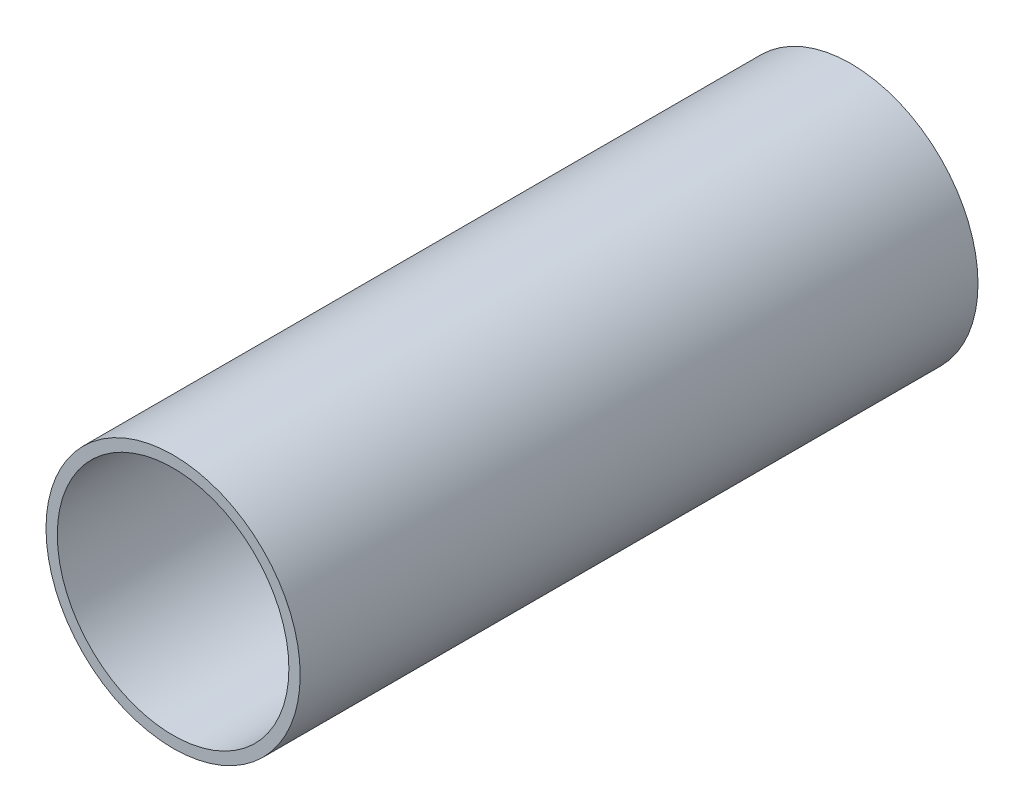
from build123d import *

# Parameters (mm, degrees)
ESQUISSE1_R        = 22.5
ESQUISSE1_R_2      = 20.5
BOSS_EXTRU_1_DEPTH = 120


with BuildPart() as part:
    # Esquisse1 → Boss.-Extru.1 (new body)
    with BuildSketch(Plane.XY):
        Circle(ESQUISSE1_R)
        Circle(ESQUISSE1_R_2, mode=Mode.SUBTRACT)
    extrude(amount=BOSS_EXTRU_1_DEPTH)


solid = part.part
